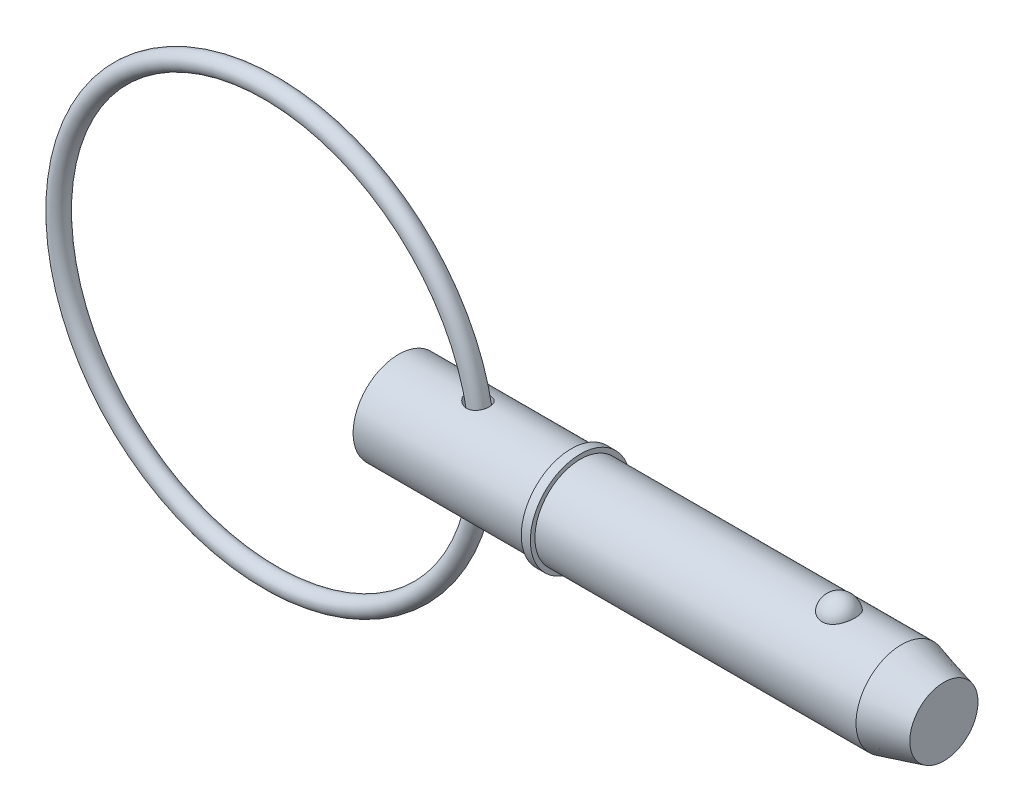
ISO-10303-21;
HEADER;
FILE_DESCRIPTION(('STEP AP214'),'2;1');
FILE_NAME('part.step','',(''),(''),'','','');
FILE_SCHEMA(('AUTOMOTIVE_DESIGN { 1 0 10303 214 1 1 1 1 }'));
ENDSEC;
DATA;
#1=APPLICATION_CONTEXT('core data for automotive mechanical design processes');
#2=APPLICATION_PROTOCOL_DEFINITION('international standard','automotive_design',2000,#1);
#3=PRODUCT_CONTEXT('',#1,'mechanical');
#4=PRODUCT('Part','Part','',(#3));
#5=PRODUCT_RELATED_PRODUCT_CATEGORY('part','',(#4));
#6=PRODUCT_DEFINITION_FORMATION('','',#4);
#7=PRODUCT_DEFINITION_CONTEXT('part definition',#1,'design');
#8=PRODUCT_DEFINITION('design','',#6,#7);
#9=PRODUCT_DEFINITION_SHAPE('','',#8);
#10=(LENGTH_UNIT() NAMED_UNIT(*) SI_UNIT(.MILLI.,.METRE.));
#11=(NAMED_UNIT(*) PLANE_ANGLE_UNIT() SI_UNIT($,.RADIAN.));
#12=(NAMED_UNIT(*) SI_UNIT($,.STERADIAN.) SOLID_ANGLE_UNIT());
#13=UNCERTAINTY_MEASURE_WITH_UNIT(LENGTH_MEASURE(1.E-05),#10,'distance_accuracy_value','');
#14=(GEOMETRIC_REPRESENTATION_CONTEXT(3) GLOBAL_UNCERTAINTY_ASSIGNED_CONTEXT((#13)) GLOBAL_UNIT_ASSIGNED_CONTEXT((#10,
#11,#12)) REPRESENTATION_CONTEXT('',''));
#15=CARTESIAN_POINT('',(0.,0.,0.));
#16=DIRECTION('',(0.,0.,1.));
#17=DIRECTION('',(1.,0.,0.));
#18=AXIS2_PLACEMENT_3D('',#15,#16,#17);
#19=CARTESIAN_POINT('',(-13.4013067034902,0.,0.));
#20=DIRECTION('',(0.,0.,1.));
#21=DIRECTION('',(1.,0.,0.));
#22=AXIS2_PLACEMENT_3D('',#19,#20,#21);
#23=TOROIDAL_SURFACE('',#22,22.225,0.952999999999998);
#24=CARTESIAN_POINT('',(9.77669329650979,0.,0.));
#25=VERTEX_POINT('',#24);
#26=VERTEX_LOOP('',#25);
#27=FACE_BOUND('',#26,.T.);
#28=ADVANCED_FACE('P0_F12',(#27),#23,.T.);
#29=CLOSED_SHELL('',(#28));
#30=MANIFOLD_SOLID_BREP('P0_B1',#29);
#31=CARTESIAN_POINT('',(0.,0.,0.));
#32=DIRECTION('',(1.,0.,0.));
#33=DIRECTION('',(0.,0.,-1.));
#34=AXIS2_PLACEMENT_3D('',#31,#32,#33);
#35=CYLINDRICAL_SURFACE('',#34,4.765);
#36=CARTESIAN_POINT('',(7.48459594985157,4.685973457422,-0.864220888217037));
#37=CARTESIAN_POINT('',(7.53849733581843,4.67711144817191,-0.912273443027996));
#38=CARTESIAN_POINT('',(7.59654891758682,4.66833039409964,-0.955745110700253));
#39=CARTESIAN_POINT('',(7.71924602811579,4.65195567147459,-1.03251233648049));
#40=CARTESIAN_POINT('',(7.78389917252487,4.64436340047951,-1.06579596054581));
#41=CARTESIAN_POINT('',(7.91808098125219,4.63129108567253,-1.12124172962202));
#42=CARTESIAN_POINT('',(7.98761280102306,4.62581242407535,-1.14339659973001));
#43=CARTESIAN_POINT('',(8.12956198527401,4.61771699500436,-1.17566870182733));
#44=CARTESIAN_POINT('',(8.20197774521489,4.61509865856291,-1.18579253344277));
#45=CARTESIAN_POINT('',(8.34550810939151,4.6131791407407,-1.19323853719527));
#46=CARTESIAN_POINT('',(8.41660306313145,4.61378793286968,-1.19090812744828));
#47=CARTESIAN_POINT('',(8.55721866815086,4.61812874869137,-1.17396277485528));
#48=CARTESIAN_POINT('',(8.62673979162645,4.62185982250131,-1.15935156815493));
#49=CARTESIAN_POINT('',(8.75801373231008,4.63172632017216,-1.11925454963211));
#50=CARTESIAN_POINT('',(8.81998342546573,4.63771186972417,-1.09443918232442));
#51=CARTESIAN_POINT('',(8.93863698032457,4.65140179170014,-1.03470792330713));
#52=CARTESIAN_POINT('',(8.99532131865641,4.65910600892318,-0.999792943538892));
#53=CARTESIAN_POINT('',(9.10080884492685,4.67519705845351,-0.921583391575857));
#54=CARTESIAN_POINT('',(9.14973848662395,4.68356861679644,-0.878455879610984));
#55=CARTESIAN_POINT('',(9.23971126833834,4.70019813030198,-0.784620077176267));
#56=CARTESIAN_POINT('',(9.28075401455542,4.7084560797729,-0.733911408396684));
#57=CARTESIAN_POINT('',(9.35441071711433,4.7240688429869,-0.62563775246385));
#58=CARTESIAN_POINT('',(9.38691359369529,4.73141115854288,-0.567995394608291));
#59=CARTESIAN_POINT('',(9.44203216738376,4.74427907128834,-0.447974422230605));
#60=CARTESIAN_POINT('',(9.46464743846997,4.74980459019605,-0.385595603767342));
#61=CARTESIAN_POINT('',(9.49961110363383,4.75848927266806,-0.257248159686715));
#62=CARTESIAN_POINT('',(9.51186382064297,4.76162635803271,-0.191251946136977));
#63=CARTESIAN_POINT('',(9.52545294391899,4.76511165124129,-0.0580729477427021));
#64=CARTESIAN_POINT('',(9.52678936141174,4.76545986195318,0.00910983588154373));
#65=CARTESIAN_POINT('',(9.51851557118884,4.76333054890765,0.142723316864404));
#66=CARTESIAN_POINT('',(9.50891008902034,4.76085424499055,0.209154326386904));
#67=CARTESIAN_POINT('',(9.47899306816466,4.75334441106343,0.339411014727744));
#68=CARTESIAN_POINT('',(9.45868126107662,4.74831081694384,0.403236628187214));
#69=CARTESIAN_POINT('',(9.4078294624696,4.73622777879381,0.526509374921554));
#70=CARTESIAN_POINT('',(9.37728413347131,4.72917728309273,0.585954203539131));
#71=CARTESIAN_POINT('',(9.30671117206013,4.71383320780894,0.698745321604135));
#72=CARTESIAN_POINT('',(9.26668347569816,4.70553961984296,0.752091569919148));
#73=CARTESIAN_POINT('',(9.17821531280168,4.68864637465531,0.851083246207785));
#74=CARTESIAN_POINT('',(9.12978756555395,4.68004719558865,0.896740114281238));
#75=CARTESIAN_POINT('',(9.02575872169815,4.66350833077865,0.97912505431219));
#76=CARTESIAN_POINT('',(8.97015856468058,4.65556855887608,1.01585429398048));
#77=CARTESIAN_POINT('',(8.85409306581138,4.6413534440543,1.0789347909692));
#78=CARTESIAN_POINT('',(8.79369898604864,4.63505812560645,1.10541268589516));
#79=CARTESIAN_POINT('',(8.66918290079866,4.62469916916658,1.1479836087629));
#80=CARTESIAN_POINT('',(8.60506121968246,4.62063533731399,1.1640775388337));
#81=CARTESIAN_POINT('',(8.47537782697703,4.61517348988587,1.18554696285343));
#82=CARTESIAN_POINT('',(8.4098281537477,4.61375835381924,1.19099130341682));
#83=CARTESIAN_POINT('',(8.2786938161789,4.61362908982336,1.19149080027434));
#84=CARTESIAN_POINT('',(8.21310914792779,4.61491539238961,1.18654430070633));
#85=CARTESIAN_POINT('',(8.08152457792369,4.62006017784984,1.16635311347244));
#86=CARTESIAN_POINT('',(8.01557748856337,4.62399895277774,1.15078675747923));
#87=CARTESIAN_POINT('',(7.88704537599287,4.63403793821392,1.10966738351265));
#88=CARTESIAN_POINT('',(7.82446148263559,4.64013886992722,1.08411103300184));
#89=CARTESIAN_POINT('',(7.70057947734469,4.65423592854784,1.02195168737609));
#90=CARTESIAN_POINT('',(7.63957197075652,4.66232221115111,0.984788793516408));
#91=CARTESIAN_POINT('',(7.52457021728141,4.67924552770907,0.900950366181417));
#92=CARTESIAN_POINT('',(7.47057819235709,4.68808279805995,0.854271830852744));
#93=CARTESIAN_POINT('',(7.37028930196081,4.70567913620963,0.751386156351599));
#94=CARTESIAN_POINT('',(7.32416327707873,4.7144333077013,0.695010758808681));
#95=CARTESIAN_POINT('',(7.24276674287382,4.73060166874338,0.574719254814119));
#96=CARTESIAN_POINT('',(7.20749051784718,4.73801656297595,0.510807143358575));
#97=CARTESIAN_POINT('',(7.15148495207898,4.75009927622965,0.381705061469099));
#98=CARTESIAN_POINT('',(7.12994463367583,4.7549169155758,0.31688231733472));
#99=CARTESIAN_POINT('',(7.09904467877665,4.76189692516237,0.184270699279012));
#100=CARTESIAN_POINT('',(7.08967554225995,4.76406136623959,0.116484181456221));
#101=CARTESIAN_POINT('',(7.08394150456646,4.76538257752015,-0.0133529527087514));
#102=CARTESIAN_POINT('',(7.0864533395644,4.76479916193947,-0.0753538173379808));
#103=CARTESIAN_POINT('',(7.10181380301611,4.76127985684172,-0.197993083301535));
#104=CARTESIAN_POINT('',(7.11466291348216,4.75834385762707,-0.258631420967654));
#105=CARTESIAN_POINT('',(7.14973937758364,4.75051877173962,-0.375744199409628));
#106=CARTESIAN_POINT('',(7.17178938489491,4.7456667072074,-0.432274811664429));
#107=CARTESIAN_POINT('',(7.22432962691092,4.73449674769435,-0.54107038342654));
#108=CARTESIAN_POINT('',(7.25481702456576,4.72817934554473,-0.593336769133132));
#109=CARTESIAN_POINT('',(7.31700895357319,4.71588241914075,-0.683642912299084));
#110=CARTESIAN_POINT('',(7.34750058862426,4.7100477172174,-0.722547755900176));
#111=CARTESIAN_POINT('',(7.41288050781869,4.69812059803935,-0.796421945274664));
#112=CARTESIAN_POINT('',(7.44776960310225,4.69202813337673,-0.831390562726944));
#113=CARTESIAN_POINT('',(7.48459594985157,4.685973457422,-0.864220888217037));
#114=B_SPLINE_CURVE_WITH_KNOTS('',3,(#36,#37,#38,#39,#40,#41,#42,#43,#44,#45,#46,#47,#48,#49,
#50,#51,#52,#53,#54,#55,#56,#57,#58,#59,#60,#61,#62,#63,#64,#65,#66,#67,#68,#69,#70,#71,#72,#73,
#74,#75,#76,#77,#78,#79,#80,#81,#82,#83,#84,#85,#86,#87,#88,#89,#90,#91,#92,#93,#94,#95,#96,#97,
#98,#99,#100,#101,#102,#103,#104,#105,#106,#107,#108,#109,#110,#111,#112,#113),.UNSPECIFIED.,
.T.,.F.,(4,2,2,2,2,2,2,2,2,2,2,2,2,2,2,2,2,2,2,2,2,2,2,2,2,2,2,2,2,2,2,2,2,2,2,2,2,2,4),(0.,
0.218078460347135,0.436411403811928,0.654886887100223,0.873242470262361,1.08553925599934,
1.2977714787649,1.49785367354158,1.6979178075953,1.8942789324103,2.09064985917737,
2.28946102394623,2.48828075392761,2.68891673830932,2.88955251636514,3.09010167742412,
3.29065586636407,3.49131482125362,3.69197512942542,3.89233421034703,4.09266707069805,
4.29043955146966,4.48819484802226,4.68466743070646,4.8811713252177,5.08390806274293,
5.28671248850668,5.50140943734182,5.71617422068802,5.93513249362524,6.15397522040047,
6.35827356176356,6.56241234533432,6.74765856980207,6.93291343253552,7.11475139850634,
7.29652829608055,7.44549570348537,7.59449062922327),.UNSPECIFIED.);
#115=CARTESIAN_POINT('',(7.48459594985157,4.685973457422,-0.864220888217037));
#116=VERTEX_POINT('',#115);
#117=EDGE_CURVE('P1_E42',#116,#116,#114,.T.);
#118=ORIENTED_EDGE('',*,*,#117,.T.);
#119=EDGE_LOOP('',(#118));
#120=FACE_BOUND('',#119,.T.);
#121=CARTESIAN_POINT('',(0.,0.,0.));
#122=DIRECTION('',(1.,0.,0.));
#123=DIRECTION('',(0.,0.,-1.));
#124=AXIS2_PLACEMENT_3D('',#121,#122,#123);
#125=CIRCLE('',#124,4.765);
#126=CARTESIAN_POINT('',(0.,0.,-4.765));
#127=VERTEX_POINT('',#126);
#128=EDGE_CURVE('P1_E9',#127,#127,#125,.T.);
#129=ORIENTED_EDGE('',*,*,#128,.T.);
#130=EDGE_LOOP('',(#129));
#131=FACE_BOUND('',#130,.T.);
#132=CARTESIAN_POINT('',(18.097,0.,0.));
#133=DIRECTION('',(1.,0.,0.));
#134=DIRECTION('',(0.,0.,-1.));
#135=AXIS2_PLACEMENT_3D('',#132,#133,#134);
#136=CIRCLE('',#135,4.765);
#137=CARTESIAN_POINT('',(18.097,0.,-4.765));
#138=VERTEX_POINT('',#137);
#139=EDGE_CURVE('P1_E25',#138,#138,#136,.T.);
#140=ORIENTED_EDGE('',*,*,#139,.F.);
#141=EDGE_LOOP('',(#140));
#142=FACE_BOUND('',#141,.T.);
#143=CARTESIAN_POINT('',(7.48459594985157,-4.685973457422,-0.864220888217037));
#144=CARTESIAN_POINT('',(7.43440944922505,-4.6942250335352,-0.819477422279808));
#145=CARTESIAN_POINT('',(7.38778663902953,-4.70255210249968,-0.77073361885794));
#146=CARTESIAN_POINT('',(7.3030968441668,-4.7184989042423,-0.666172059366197));
#147=CARTESIAN_POINT('',(7.26503010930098,-4.72611861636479,-0.610354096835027));
#148=CARTESIAN_POINT('',(7.19878266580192,-4.73983819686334,-0.492624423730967));
#149=CARTESIAN_POINT('',(7.17064194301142,-4.74593188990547,-0.430689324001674));
#150=CARTESIAN_POINT('',(7.12584349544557,-4.75581281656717,-0.3026233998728));
#151=CARTESIAN_POINT('',(7.10917889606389,-4.75960143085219,-0.236495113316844));
#152=CARTESIAN_POINT('',(7.0889853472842,-4.76421379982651,-0.106818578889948));
#153=CARTESIAN_POINT('',(7.0846333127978,-4.76522320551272,-0.0434047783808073));
#154=CARTESIAN_POINT('',(7.08693064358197,-4.7646936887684,0.0832041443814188));
#155=CARTESIAN_POINT('',(7.09357756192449,-4.76315533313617,0.146399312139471));
#156=CARTESIAN_POINT('',(7.11694629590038,-4.75784365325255,0.267709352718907));
#157=CARTESIAN_POINT('',(7.13318365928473,-4.75417793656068,0.325923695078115));
#158=CARTESIAN_POINT('',(7.17459606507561,-4.74508048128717,0.438922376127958));
#159=CARTESIAN_POINT('',(7.19977257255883,-4.73964845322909,0.493706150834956));
#160=CARTESIAN_POINT('',(7.25946789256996,-4.72725615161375,0.60111049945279));
#161=CARTESIAN_POINT('',(7.2943661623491,-4.72023663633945,0.653512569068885));
#162=CARTESIAN_POINT('',(7.37173226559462,-4.70550732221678,0.752279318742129));
#163=CARTESIAN_POINT('',(7.41420315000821,-4.69779724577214,0.798641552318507));
#164=CARTESIAN_POINT('',(7.50982312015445,-4.6816641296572,0.888551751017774));
#165=CARTESIAN_POINT('',(7.56359853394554,-4.67324162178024,0.931434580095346));
#166=CARTESIAN_POINT('',(7.67736628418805,-4.65728554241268,1.00819498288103));
#167=CARTESIAN_POINT('',(7.7373611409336,-4.64975233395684,1.04206888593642));
#168=CARTESIAN_POINT('',(7.86574076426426,-4.63599923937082,1.10169445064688));
#169=CARTESIAN_POINT('',(7.93441048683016,-4.62988111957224,1.12685968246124));
#170=CARTESIAN_POINT('',(8.07519000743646,-4.62035710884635,1.16529928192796));
#171=CARTESIAN_POINT('',(8.14729925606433,-4.61695078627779,1.1785755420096));
#172=CARTESIAN_POINT('',(8.29111621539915,-4.61341807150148,1.19232949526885));
#173=CARTESIAN_POINT('',(8.36279361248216,-4.61321655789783,1.19310032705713));
#174=CARTESIAN_POINT('',(8.50512944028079,-4.61602317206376,1.1821962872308));
#175=CARTESIAN_POINT('',(8.57578827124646,-4.61903000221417,1.17052644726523));
#176=CARTESIAN_POINT('',(8.70965757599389,-4.62766311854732,1.13589249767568));
#177=CARTESIAN_POINT('',(8.77306169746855,-4.63312492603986,1.11363308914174));
#178=CARTESIAN_POINT('',(8.8949702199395,-4.64598463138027,1.05869880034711));
#179=CARTESIAN_POINT('',(8.95347516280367,-4.65338231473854,1.02602507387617));
#180=CARTESIAN_POINT('',(9.06253415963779,-4.66906009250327,0.952097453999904));
#181=CARTESIAN_POINT('',(9.11324728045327,-4.67731427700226,0.911072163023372));
#182=CARTESIAN_POINT('',(9.20707850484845,-4.69393979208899,0.821122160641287));
#183=CARTESIAN_POINT('',(9.25019629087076,-4.70231112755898,0.772197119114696));
#184=CARTESIAN_POINT('',(9.32819072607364,-4.71835356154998,0.667239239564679));
#185=CARTESIAN_POINT('',(9.36297449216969,-4.72601623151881,0.611136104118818));
#186=CARTESIAN_POINT('',(9.42286382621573,-4.73971239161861,0.493799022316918));
#187=CARTESIAN_POINT('',(9.44796891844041,-4.74574580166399,0.432564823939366));
#188=CARTESIAN_POINT('',(9.48811605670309,-4.75559286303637,0.305990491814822));
#189=CARTESIAN_POINT('',(9.50304870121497,-4.75938232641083,0.240613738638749));
#190=CARTESIAN_POINT('',(9.5220569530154,-4.76423188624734,0.108201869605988));
#191=CARTESIAN_POINT('',(9.52613255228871,-4.76529198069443,0.0411667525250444));
#192=CARTESIAN_POINT('',(9.52332772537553,-4.76456884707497,-0.0926701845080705));
#193=CARTESIAN_POINT('',(9.51644541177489,-4.76278512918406,-0.159471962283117));
#194=CARTESIAN_POINT('',(9.49188827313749,-4.75656536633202,-0.290934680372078));
#195=CARTESIAN_POINT('',(9.47421322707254,-4.75212926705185,-0.355595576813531));
#196=CARTESIAN_POINT('',(9.42849503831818,-4.74108318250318,-0.480955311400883));
#197=CARTESIAN_POINT('',(9.4004503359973,-4.73447287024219,-0.541653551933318));
#198=CARTESIAN_POINT('',(9.33467290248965,-4.71979928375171,-0.657361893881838));
#199=CARTESIAN_POINT('',(9.29694000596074,-4.71173598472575,-0.712371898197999));
#200=CARTESIAN_POINT('',(9.2127449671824,-4.69505469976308,-0.815106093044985));
#201=CARTESIAN_POINT('',(9.1662875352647,-4.68643701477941,-0.862834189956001));
#202=CARTESIAN_POINT('',(9.06584125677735,-4.66961864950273,-0.949656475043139));
#203=CARTESIAN_POINT('',(9.01185326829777,-4.66141792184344,-0.98875164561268));
#204=CARTESIAN_POINT('',(8.8985010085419,-4.64646376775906,-1.0567894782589));
#205=CARTESIAN_POINT('',(8.83920621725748,-4.63969468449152,-1.08584444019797));
#206=CARTESIAN_POINT('',(8.71642097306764,-4.62824519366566,-1.13365785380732));
#207=CARTESIAN_POINT('',(8.65293102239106,-4.623564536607,-1.15241753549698));
#208=CARTESIAN_POINT('',(8.52421291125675,-4.61681938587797,-1.17914952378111));
#209=CARTESIAN_POINT('',(8.45900634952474,-4.6147310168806,-1.18722032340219));
#210=CARTESIAN_POINT('',(8.32811210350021,-4.61325848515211,-1.19292878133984));
#211=CARTESIAN_POINT('',(8.26242433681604,-4.61387479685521,-1.19056460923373));
#212=CARTESIAN_POINT('',(8.13057358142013,-4.6177227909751,-1.17555160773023));
#213=CARTESIAN_POINT('',(8.06444352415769,-4.62102282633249,-1.16263394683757));
#214=CARTESIAN_POINT('',(7.93513143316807,-4.62989870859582,-1.12676570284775));
#215=CARTESIAN_POINT('',(7.87194976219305,-4.6354748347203,-1.10381388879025));
#216=CARTESIAN_POINT('',(7.75155849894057,-4.64811746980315,-1.04928030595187));
#217=CARTESIAN_POINT('',(7.69423767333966,-4.65514232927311,-1.01793362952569));
#218=CARTESIAN_POINT('',(7.58503138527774,-4.67007903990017,-0.947046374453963));
#219=CARTESIAN_POINT('',(7.53314612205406,-4.67799092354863,-0.907505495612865));
#220=CARTESIAN_POINT('',(7.48459594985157,-4.685973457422,-0.864220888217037));
#221=B_SPLINE_CURVE_WITH_KNOTS('',3,(#143,#144,#145,#146,#147,#148,#149,#150,#151,#152,#153,
#154,#155,#156,#157,#158,#159,#160,#161,#162,#163,#164,#165,#166,#167,#168,#169,#170,#171,#172,
#173,#174,#175,#176,#177,#178,#179,#180,#181,#182,#183,#184,#185,#186,#187,#188,#189,#190,#191,
#192,#193,#194,#195,#196,#197,#198,#199,#200,#201,#202,#203,#204,#205,#206,#207,#208,#209,#210,
#211,#212,#213,#214,#215,#216,#217,#218,#219,#220),.UNSPECIFIED.,.T.,.F.,(4,2,2,2,2,2,2,2,2,2,2,
2,2,2,2,2,2,2,2,2,2,2,2,2,2,2,2,2,2,2,2,2,2,2,2,2,2,2,4),(0.,0.203013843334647,
0.406033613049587,0.609862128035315,0.813568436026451,1.0032929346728,1.19297523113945,
1.37380897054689,1.55467236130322,1.74393241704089,1.93326889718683,2.14025373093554,
2.3473227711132,2.566425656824,2.78549366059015,2.9994188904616,3.21325763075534,
3.41451842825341,3.61575693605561,3.81208930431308,4.00842987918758,4.20686629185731,
4.40531245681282,4.60586051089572,4.80640871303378,5.0069914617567,5.20757831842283,
5.40819535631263,5.60881581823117,5.80932827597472,6.00981790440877,6.2079863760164,
6.40613116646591,6.60243714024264,6.79877754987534,7.00028133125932,7.20180983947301,
7.39819723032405,7.59459181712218),.UNSPECIFIED.);
#222=CARTESIAN_POINT('',(7.48459594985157,-4.685973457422,-0.864220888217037));
#223=VERTEX_POINT('',#222);
#224=EDGE_CURVE('P1_E17',#223,#223,#221,.T.);
#225=ORIENTED_EDGE('',*,*,#224,.T.);
#226=EDGE_LOOP('',(#225));
#227=FACE_BOUND('',#226,.T.);
#228=ADVANCED_FACE('P1_F13',(#120,#131,#142,#227),#35,.T.);
#229=CARTESIAN_POINT('',(0.,0.,0.));
#230=DIRECTION('',(1.,0.,0.));
#231=DIRECTION('',(0.,0.,-1.));
#232=AXIS2_PLACEMENT_3D('',#229,#230,#231);
#233=CYLINDRICAL_SURFACE('',#232,4.765);
#234=CARTESIAN_POINT('',(52.7041944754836,0.,0.));
#235=DIRECTION('',(1.,0.,0.));
#236=DIRECTION('',(0.,0.,-1.));
#237=AXIS2_PLACEMENT_3D('',#234,#235,#236);
#238=CIRCLE('',#237,4.765);
#239=CARTESIAN_POINT('',(52.7041944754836,0.,-4.765));
#240=VERTEX_POINT('',#239);
#241=EDGE_CURVE('P1_E99',#240,#240,#238,.T.);
#242=ORIENTED_EDGE('',*,*,#241,.F.);
#243=EDGE_LOOP('',(#242));
#244=FACE_BOUND('',#243,.T.);
#245=CARTESIAN_POINT('',(19.05,0.,0.));
#246=DIRECTION('',(1.,0.,0.));
#247=DIRECTION('',(0.,0.,-1.));
#248=AXIS2_PLACEMENT_3D('',#245,#246,#247);
#249=CIRCLE('',#248,4.765);
#250=CARTESIAN_POINT('',(19.05,0.,-4.765));
#251=VERTEX_POINT('',#250);
#252=EDGE_CURVE('P1_E96',#251,#251,#249,.T.);
#253=ORIENTED_EDGE('',*,*,#252,.T.);
#254=EDGE_LOOP('',(#253));
#255=FACE_BOUND('',#254,.T.);
#256=CARTESIAN_POINT('',(46.151020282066,4.42764777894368,1.76101111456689));
#257=CARTESIAN_POINT('',(46.0597212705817,4.42764470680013,1.76101422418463));
#258=CARTESIAN_POINT('',(45.9684468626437,4.43059091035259,1.75366340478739));
#259=CARTESIAN_POINT('',(45.7886154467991,4.44201846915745,1.72451180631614));
#260=CARTESIAN_POINT('',(45.7000577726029,4.45049845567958,1.70271460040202));
#261=CARTESIAN_POINT('',(45.5282570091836,4.47200516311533,1.64539370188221));
#262=CARTESIAN_POINT('',(45.4450064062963,4.48502527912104,1.60988994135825));
#263=CARTESIAN_POINT('',(45.2857633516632,4.51419542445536,1.52617873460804));
#264=CARTESIAN_POINT('',(45.2097723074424,4.53034605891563,1.47796883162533));
#265=CARTESIAN_POINT('',(45.0647445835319,4.56459317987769,1.36860494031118));
#266=CARTESIAN_POINT('',(44.9959645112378,4.58273170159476,1.30712420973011));
#267=CARTESIAN_POINT('',(44.8693423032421,4.61870302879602,1.17370204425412));
#268=CARTESIAN_POINT('',(44.8115021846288,4.63653577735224,1.10175868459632));
#269=CARTESIAN_POINT('',(44.7055709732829,4.67090140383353,0.94580676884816));
#270=CARTESIAN_POINT('',(44.6580305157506,4.68734068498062,0.861402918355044));
#271=CARTESIAN_POINT('',(44.5770817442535,4.71628466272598,0.685442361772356));
#272=CARTESIAN_POINT('',(44.5436747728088,4.72878898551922,0.593884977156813));
#273=CARTESIAN_POINT('',(44.491287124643,4.74874061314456,0.404781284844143));
#274=CARTESIAN_POINT('',(44.4725178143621,4.75611366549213,0.307168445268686));
#275=CARTESIAN_POINT('',(44.4505846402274,4.76475393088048,0.109940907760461));
#276=CARTESIAN_POINT('',(44.4474205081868,4.76602124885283,0.0103262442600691));
#277=CARTESIAN_POINT('',(44.4567405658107,4.76232928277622,-0.187629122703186));
#278=CARTESIAN_POINT('',(44.4691588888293,4.7573962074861,-0.285973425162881));
#279=CARTESIAN_POINT('',(44.5092804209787,4.74184975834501,-0.479027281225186));
#280=CARTESIAN_POINT('',(44.5369839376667,4.7312362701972,-0.573736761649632));
#281=CARTESIAN_POINT('',(44.6071581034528,4.70540026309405,-0.756973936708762));
#282=CARTESIAN_POINT('',(44.6496460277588,4.69017235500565,-0.845494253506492));
#283=CARTESIAN_POINT('',(44.748520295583,4.6566986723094,-1.01378033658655));
#284=CARTESIAN_POINT('',(44.8049076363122,4.63845268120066,-1.09354547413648));
#285=CARTESIAN_POINT('',(44.930552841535,4.60085438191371,-1.24228523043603));
#286=CARTESIAN_POINT('',(44.9998439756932,4.58149930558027,-1.31123108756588));
#287=CARTESIAN_POINT('',(45.1496066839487,4.54391653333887,-1.43607409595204));
#288=CARTESIAN_POINT('',(45.2300771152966,4.52568872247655,-1.4919725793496));
#289=CARTESIAN_POINT('',(45.3981500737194,4.49293007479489,-1.58786764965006));
#290=CARTESIAN_POINT('',(45.4855445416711,4.47832346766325,-1.62820219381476));
#291=CARTESIAN_POINT('',(45.666553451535,4.45406011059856,-1.69345757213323));
#292=CARTESIAN_POINT('',(45.7601655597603,4.44440151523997,-1.71838415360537));
#293=CARTESIAN_POINT('',(45.9458939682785,4.43159888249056,-1.75112843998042));
#294=CARTESIAN_POINT('',(46.037849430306,4.42815213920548,-1.75974223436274));
#295=CARTESIAN_POINT('',(46.2219658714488,4.427247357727,-1.76201865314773));
#296=CARTESIAN_POINT('',(46.3141268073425,4.42978816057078,-1.7556841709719));
#297=CARTESIAN_POINT('',(46.4931292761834,4.44038648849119,-1.72869560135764));
#298=CARTESIAN_POINT('',(46.5800474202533,4.44827555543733,-1.70847853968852));
#299=CARTESIAN_POINT('',(46.7491314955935,4.46852246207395,-1.65479562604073));
#300=CARTESIAN_POINT('',(46.8312970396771,4.48088066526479,-1.62132869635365));
#301=CARTESIAN_POINT('',(46.9905916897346,4.50907357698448,-1.54120560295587));
#302=CARTESIAN_POINT('',(47.0675700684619,4.52497884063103,-1.49427526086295));
#303=CARTESIAN_POINT('',(47.2127080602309,4.55845148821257,-1.38881222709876));
#304=CARTESIAN_POINT('',(47.2808656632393,4.57601924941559,-1.3302768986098));
#305=CARTESIAN_POINT('',(47.4100990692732,4.61196537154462,-1.1999104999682));
#306=CARTESIAN_POINT('',(47.4706562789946,4.63034074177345,-1.12756415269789));
#307=CARTESIAN_POINT('',(47.5792797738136,4.66513959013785,-0.973612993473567));
#308=CARTESIAN_POINT('',(47.6273438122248,4.68156271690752,-0.892006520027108));
#309=CARTESIAN_POINT('',(47.711383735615,4.71130224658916,-0.718892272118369));
#310=CARTESIAN_POINT('',(47.7469185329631,4.724501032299,-0.62714967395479));
#311=CARTESIAN_POINT('',(47.8029522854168,4.74571823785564,-0.438611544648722));
#312=CARTESIAN_POINT('',(47.823450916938,4.75373654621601,-0.341815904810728));
#313=CARTESIAN_POINT('',(47.8490338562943,4.76378905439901,-0.145633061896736));
#314=CARTESIAN_POINT('',(47.854076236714,4.76580697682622,-0.0462395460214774));
#315=CARTESIAN_POINT('',(47.8485239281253,4.7636057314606,0.152038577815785));
#316=CARTESIAN_POINT('',(47.8379294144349,4.75938663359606,0.250923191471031));
#317=CARTESIAN_POINT('',(47.8013875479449,4.74516937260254,0.445004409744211));
#318=CARTESIAN_POINT('',(47.7754964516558,4.73519238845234,0.540213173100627));
#319=CARTESIAN_POINT('',(47.7089273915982,4.7104939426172,0.724662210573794));
#320=CARTESIAN_POINT('',(47.668248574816,4.69577220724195,0.813902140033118));
#321=CARTESIAN_POINT('',(47.5727177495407,4.66303767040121,0.984313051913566));
#322=CARTESIAN_POINT('',(47.5178042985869,4.64501070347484,1.06544688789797));
#323=CARTESIAN_POINT('',(47.3950496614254,4.60764678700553,1.21692673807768));
#324=CARTESIAN_POINT('',(47.3272086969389,4.58830985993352,1.2872729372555));
#325=CARTESIAN_POINT('',(47.1805480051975,4.55060370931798,1.41479271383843));
#326=CARTESIAN_POINT('',(47.1017918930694,4.53222967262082,1.47203785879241));
#327=CARTESIAN_POINT('',(46.9349890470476,4.49849576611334,1.57212016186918));
#328=CARTESIAN_POINT('',(46.8469417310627,4.48313608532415,1.61495641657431));
#329=CARTESIAN_POINT('',(46.6597918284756,4.45676184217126,1.68642657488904));
#330=CARTESIAN_POINT('',(46.5603653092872,4.44598302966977,1.71430590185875));
#331=CARTESIAN_POINT('',(46.3576210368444,4.43142918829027,1.75159258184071));
#332=CARTESIAN_POINT('',(46.2543049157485,4.42765125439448,1.76100759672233));
#333=CARTESIAN_POINT('',(46.151020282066,4.42764777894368,1.76101111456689));
#334=B_SPLINE_CURVE_WITH_KNOTS('',3,(#256,#257,#258,#259,#260,#261,#262,#263,#264,#265,#266,
#267,#268,#269,#270,#271,#272,#273,#274,#275,#276,#277,#278,#279,#280,#281,#282,#283,#284,#285,
#286,#287,#288,#289,#290,#291,#292,#293,#294,#295,#296,#297,#298,#299,#300,#301,#302,#303,#304,
#305,#306,#307,#308,#309,#310,#311,#312,#313,#314,#315,#316,#317,#318,#319,#320,#321,#322,#323,
#324,#325,#326,#327,#328,#329,#330,#331,#332,#333),.UNSPECIFIED.,.T.,.F.,(4,2,2,2,2,2,2,2,2,2,2,
2,2,2,2,2,2,2,2,2,2,2,2,2,2,2,2,2,2,2,2,2,2,2,2,2,2,2,4),(0.,0.273517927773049,
0.546968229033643,0.820022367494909,1.09312934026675,1.37393946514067,1.65480131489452,
1.94820420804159,2.24163496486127,2.53922817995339,2.83681628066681,3.1331507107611,
3.42949110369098,3.72617893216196,4.02288805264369,4.32037303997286,4.61782764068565,
4.9084009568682,5.1988658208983,5.47474855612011,5.7505778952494,6.01809977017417,
6.2856434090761,6.55907787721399,6.8325745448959,7.11962987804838,7.40673679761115,
7.70312663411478,7.99952284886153,8.29672237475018,8.59391856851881,8.8900285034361,
9.18615552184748,9.48358266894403,9.78100471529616,10.0767610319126,10.3725358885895,
10.6820893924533,10.9915144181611),.UNSPECIFIED.);
#335=CARTESIAN_POINT('',(46.151020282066,4.42764777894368,1.76101111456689));
#336=VERTEX_POINT('',#335);
#337=EDGE_CURVE('P1_E34',#336,#336,#334,.T.);
#338=ORIENTED_EDGE('',*,*,#337,.T.);
#339=EDGE_LOOP('',(#338));
#340=FACE_BOUND('',#339,.T.);
#341=ADVANCED_FACE('P1_F46',(#244,#255,#340),#233,.T.);
#342=CARTESIAN_POINT('',(0.,0.,0.));
#343=DIRECTION('',(-1.,0.,0.));
#344=DIRECTION('',(0.,0.,1.));
#345=AXIS2_PLACEMENT_3D('',#342,#343,#344);
#346=PLANE('',#345);
#347=ORIENTED_EDGE('',*,*,#128,.F.);
#348=EDGE_LOOP('',(#347));
#349=FACE_BOUND('',#348,.T.);
#350=ADVANCED_FACE('P1_F15',(#349),#346,.T.);
#351=CARTESIAN_POINT('',(18.097,4.765,0.));
#352=DIRECTION('',(-1.,0.,0.));
#353=DIRECTION('',(0.,0.,1.));
#354=AXIS2_PLACEMENT_3D('',#351,#352,#353);
#355=PLANE('',#354);
#356=ORIENTED_EDGE('',*,*,#139,.T.);
#357=EDGE_LOOP('',(#356));
#358=FACE_BOUND('',#357,.T.);
#359=CARTESIAN_POINT('',(18.097,0.,0.));
#360=DIRECTION('',(1.,0.,0.));
#361=DIRECTION('',(0.,0.,-1.));
#362=AXIS2_PLACEMENT_3D('',#359,#360,#361);
#363=CIRCLE('',#362,5.2415);
#364=CARTESIAN_POINT('',(18.097,0.,-5.2415));
#365=VERTEX_POINT('',#364);
#366=EDGE_CURVE('P1_E30',#365,#365,#363,.T.);
#367=ORIENTED_EDGE('',*,*,#366,.F.);
#368=EDGE_LOOP('',(#367));
#369=FACE_BOUND('',#368,.T.);
#370=ADVANCED_FACE('P1_F81',(#358,#369),#355,.T.);
#371=CARTESIAN_POINT('',(0.,0.,0.));
#372=DIRECTION('',(1.,0.,0.));
#373=DIRECTION('',(0.,0.,-1.));
#374=AXIS2_PLACEMENT_3D('',#371,#372,#373);
#375=CYLINDRICAL_SURFACE('',#374,5.2415);
#376=ORIENTED_EDGE('',*,*,#366,.T.);
#377=EDGE_LOOP('',(#376));
#378=FACE_BOUND('',#377,.T.);
#379=CARTESIAN_POINT('',(19.05,0.,0.));
#380=DIRECTION('',(1.,0.,0.));
#381=DIRECTION('',(0.,0.,-1.));
#382=AXIS2_PLACEMENT_3D('',#379,#380,#381);
#383=CIRCLE('',#382,5.2415);
#384=CARTESIAN_POINT('',(19.05,0.,-5.2415));
#385=VERTEX_POINT('',#384);
#386=EDGE_CURVE('P1_E95',#385,#385,#383,.T.);
#387=ORIENTED_EDGE('',*,*,#386,.F.);
#388=EDGE_LOOP('',(#387));
#389=FACE_BOUND('',#388,.T.);
#390=ADVANCED_FACE('P1_F68',(#378,#389),#375,.T.);
#391=CARTESIAN_POINT('',(19.05,5.2415,0.));
#392=DIRECTION('',(1.,0.,0.));
#393=DIRECTION('',(0.,0.,-1.));
#394=AXIS2_PLACEMENT_3D('',#391,#392,#393);
#395=PLANE('',#394);
#396=ORIENTED_EDGE('',*,*,#386,.T.);
#397=EDGE_LOOP('',(#396));
#398=FACE_BOUND('',#397,.T.);
#399=ORIENTED_EDGE('',*,*,#252,.F.);
#400=EDGE_LOOP('',(#399));
#401=FACE_BOUND('',#400,.T.);
#402=ADVANCED_FACE('P1_F62',(#398,#401),#395,.T.);
#403=CARTESIAN_POINT('',(57.15,0.,0.));
#404=DIRECTION('',(-1.,0.,0.));
#405=DIRECTION('',(0.,0.,1.));
#406=AXIS2_PLACEMENT_3D('',#403,#404,#405);
#407=CONICAL_SURFACE('',#406,3.57375000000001,0.26179938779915);
#408=ORIENTED_EDGE('',*,*,#241,.T.);
#409=EDGE_LOOP('',(#408));
#410=FACE_BOUND('',#409,.T.);
#411=CARTESIAN_POINT('',(57.15,0.,0.));
#412=DIRECTION('',(1.,0.,0.));
#413=DIRECTION('',(0.,0.,-1.));
#414=AXIS2_PLACEMENT_3D('',#411,#412,#413);
#415=CIRCLE('',#414,3.57375000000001);
#416=CARTESIAN_POINT('',(57.15,0.,-3.57375000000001));
#417=VERTEX_POINT('',#416);
#418=EDGE_CURVE('P1_E41',#417,#417,#415,.T.);
#419=ORIENTED_EDGE('',*,*,#418,.F.);
#420=EDGE_LOOP('',(#419));
#421=FACE_BOUND('',#420,.T.);
#422=ADVANCED_FACE('P1_F59',(#410,#421),#407,.T.);
#423=CARTESIAN_POINT('',(57.15,3.57375000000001,0.));
#424=DIRECTION('',(1.,0.,0.));
#425=DIRECTION('',(0.,0.,-1.));
#426=AXIS2_PLACEMENT_3D('',#423,#424,#425);
#427=PLANE('',#426);
#428=ORIENTED_EDGE('',*,*,#418,.T.);
#429=EDGE_LOOP('',(#428));
#430=FACE_BOUND('',#429,.T.);
#431=ADVANCED_FACE('P1_F55',(#430),#427,.T.);
#432=CARTESIAN_POINT('',(46.151020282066,4.28849999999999,0.));
#433=DIRECTION('',(-1.,0.,0.));
#434=DIRECTION('',(0.,1.,0.));
#435=AXIS2_PLACEMENT_3D('',#432,#433,#434);
#436=SPHERICAL_SURFACE('',#435,1.76650000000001);
#437=ORIENTED_EDGE('',*,*,#337,.F.);
#438=EDGE_LOOP('',(#437));
#439=FACE_BOUND('',#438,.T.);
#440=ADVANCED_FACE('P1_F50',(#439),#436,.T.);
#441=CARTESIAN_POINT('',(-13.4013067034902,0.,0.));
#442=DIRECTION('',(0.,0.,1.));
#443=DIRECTION('',(1.,0.,0.));
#444=AXIS2_PLACEMENT_3D('',#441,#442,#443);
#445=TOROIDAL_SURFACE('',#444,22.225,1.19125);
#446=ORIENTED_EDGE('',*,*,#224,.F.);
#447=EDGE_LOOP('',(#446));
#448=FACE_BOUND('',#447,.T.);
#449=ORIENTED_EDGE('',*,*,#117,.F.);
#450=EDGE_LOOP('',(#449));
#451=FACE_BOUND('',#450,.T.);
#452=ADVANCED_FACE('P1_F54',(#448,#451),#445,.F.);
#453=CLOSED_SHELL('',(#228,#341,#350,#370,#390,#402,#422,#431,#440,#452));
#454=MANIFOLD_SOLID_BREP('P1_B1',#453);
#455=ADVANCED_BREP_SHAPE_REPRESENTATION('',(#18,#30,#454),#14);
#456=SHAPE_DEFINITION_REPRESENTATION(#9,#455);
ENDSEC;
END-ISO-10303-21;
